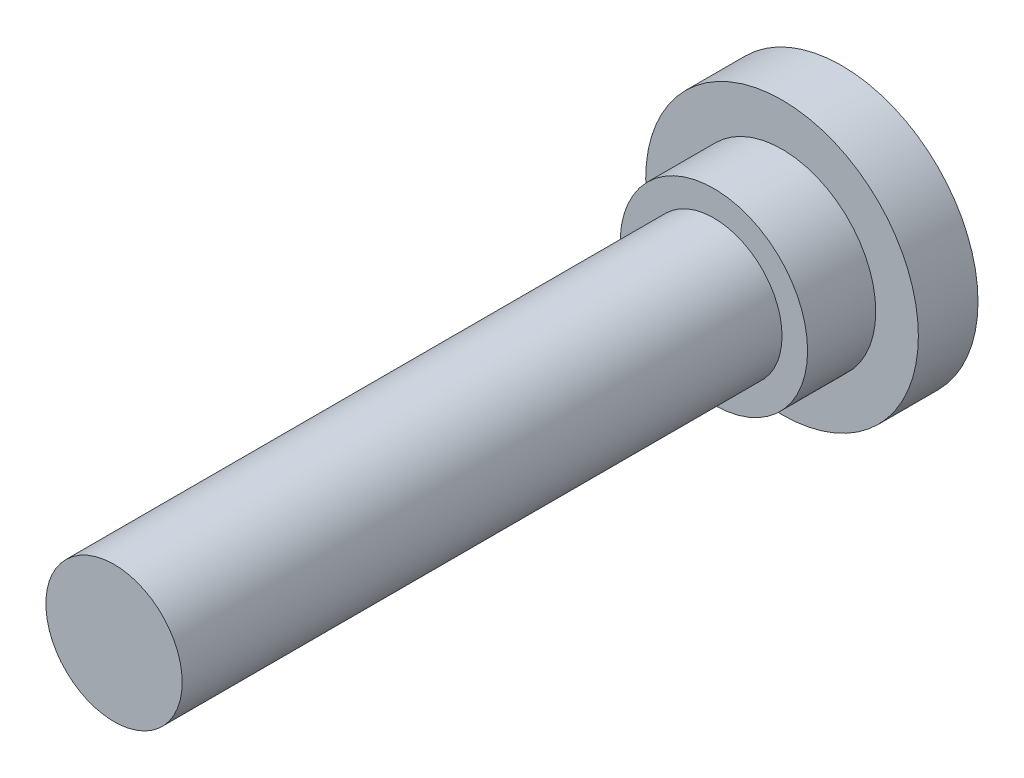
ISO-10303-21;
HEADER;
FILE_DESCRIPTION(('STEP AP214'),'2;1');
FILE_NAME('part.step','',(''),(''),'','','');
FILE_SCHEMA(('AUTOMOTIVE_DESIGN { 1 0 10303 214 1 1 1 1 }'));
ENDSEC;
DATA;
#1=APPLICATION_CONTEXT('core data for automotive mechanical design processes');
#2=APPLICATION_PROTOCOL_DEFINITION('international standard','automotive_design',2000,#1);
#3=PRODUCT_CONTEXT('',#1,'mechanical');
#4=PRODUCT('Part','Part','',(#3));
#5=PRODUCT_RELATED_PRODUCT_CATEGORY('part','',(#4));
#6=PRODUCT_DEFINITION_FORMATION('','',#4);
#7=PRODUCT_DEFINITION_CONTEXT('part definition',#1,'design');
#8=PRODUCT_DEFINITION('design','',#6,#7);
#9=PRODUCT_DEFINITION_SHAPE('','',#8);
#10=(LENGTH_UNIT() NAMED_UNIT(*) SI_UNIT(.MILLI.,.METRE.));
#11=(NAMED_UNIT(*) PLANE_ANGLE_UNIT() SI_UNIT($,.RADIAN.));
#12=(NAMED_UNIT(*) SI_UNIT($,.STERADIAN.) SOLID_ANGLE_UNIT());
#13=UNCERTAINTY_MEASURE_WITH_UNIT(LENGTH_MEASURE(1.E-05),#10,'distance_accuracy_value','');
#14=(GEOMETRIC_REPRESENTATION_CONTEXT(3) GLOBAL_UNCERTAINTY_ASSIGNED_CONTEXT((#13)) GLOBAL_UNIT_ASSIGNED_CONTEXT((#10,
#11,#12)) REPRESENTATION_CONTEXT('',''));
#15=CARTESIAN_POINT('',(0.,0.,0.));
#16=DIRECTION('',(0.,0.,1.));
#17=DIRECTION('',(1.,0.,0.));
#18=AXIS2_PLACEMENT_3D('',#15,#16,#17);
#19=CARTESIAN_POINT('',(0.,0.,85.4));
#20=DIRECTION('',(0.,0.,1.));
#21=DIRECTION('',(1.,0.,0.));
#22=AXIS2_PLACEMENT_3D('',#19,#20,#21);
#23=PLANE('',#22);
#24=CARTESIAN_POINT('',(0.,0.,85.4));
#25=DIRECTION('',(0.,0.,1.));
#26=DIRECTION('',(1.,0.,0.));
#27=AXIS2_PLACEMENT_3D('',#24,#25,#26);
#28=CIRCLE('',#27,8.);
#29=CARTESIAN_POINT('',(8.,0.,85.4));
#30=VERTEX_POINT('',#29);
#31=EDGE_CURVE('E8',#30,#30,#28,.T.);
#32=ORIENTED_EDGE('',*,*,#31,.T.);
#33=EDGE_LOOP('',(#32));
#34=FACE_BOUND('',#33,.T.);
#35=ADVANCED_FACE('F12',(#34),#23,.T.);
#36=CARTESIAN_POINT('',(0.,0.,30.));
#37=DIRECTION('',(0.,0.,1.));
#38=DIRECTION('',(1.,0.,0.));
#39=AXIS2_PLACEMENT_3D('',#36,#37,#38);
#40=CYLINDRICAL_SURFACE('',#39,8.);
#41=CARTESIAN_POINT('',(0.,0.,15.));
#42=DIRECTION('',(0.,0.,1.));
#43=DIRECTION('',(1.,0.,0.));
#44=AXIS2_PLACEMENT_3D('',#41,#42,#43);
#45=CIRCLE('',#44,8.);
#46=CARTESIAN_POINT('',(8.,0.,15.));
#47=VERTEX_POINT('',#46);
#48=EDGE_CURVE('E18',#47,#47,#45,.T.);
#49=ORIENTED_EDGE('',*,*,#48,.T.);
#50=EDGE_LOOP('',(#49));
#51=FACE_BOUND('',#50,.T.);
#52=ORIENTED_EDGE('',*,*,#31,.F.);
#53=EDGE_LOOP('',(#52));
#54=FACE_BOUND('',#53,.T.);
#55=ADVANCED_FACE('F52',(#51,#54),#40,.T.);
#56=CARTESIAN_POINT('',(-8.,0.,15.));
#57=DIRECTION('',(0.,0.,1.));
#58=DIRECTION('',(1.,0.,0.));
#59=AXIS2_PLACEMENT_3D('',#56,#57,#58);
#60=PLANE('',#59);
#61=CARTESIAN_POINT('',(0.,0.,15.));
#62=DIRECTION('',(0.,0.,1.));
#63=DIRECTION('',(1.,0.,0.));
#64=AXIS2_PLACEMENT_3D('',#61,#62,#63);
#65=CIRCLE('',#64,11.);
#66=CARTESIAN_POINT('',(11.,0.,15.));
#67=VERTEX_POINT('',#66);
#68=EDGE_CURVE('E22',#67,#67,#65,.T.);
#69=ORIENTED_EDGE('',*,*,#68,.T.);
#70=EDGE_LOOP('',(#69));
#71=FACE_BOUND('',#70,.T.);
#72=ORIENTED_EDGE('',*,*,#48,.F.);
#73=EDGE_LOOP('',(#72));
#74=FACE_BOUND('',#73,.T.);
#75=ADVANCED_FACE('F57',(#71,#74),#60,.T.);
#76=CARTESIAN_POINT('',(0.,0.,30.));
#77=DIRECTION('',(0.,0.,1.));
#78=DIRECTION('',(1.,0.,0.));
#79=AXIS2_PLACEMENT_3D('',#76,#77,#78);
#80=CYLINDRICAL_SURFACE('',#79,11.);
#81=CARTESIAN_POINT('',(0.,0.,7.));
#82=DIRECTION('',(0.,0.,1.));
#83=DIRECTION('',(1.,0.,0.));
#84=AXIS2_PLACEMENT_3D('',#81,#82,#83);
#85=CIRCLE('',#84,11.);
#86=CARTESIAN_POINT('',(11.,0.,7.));
#87=VERTEX_POINT('',#86);
#88=EDGE_CURVE('E26',#87,#87,#85,.T.);
#89=ORIENTED_EDGE('',*,*,#88,.T.);
#90=EDGE_LOOP('',(#89));
#91=FACE_BOUND('',#90,.T.);
#92=ORIENTED_EDGE('',*,*,#68,.F.);
#93=EDGE_LOOP('',(#92));
#94=FACE_BOUND('',#93,.T.);
#95=ADVANCED_FACE('F62',(#91,#94),#80,.T.);
#96=CARTESIAN_POINT('',(-11.,0.,7.));
#97=DIRECTION('',(0.,0.,1.));
#98=DIRECTION('',(1.,0.,0.));
#99=AXIS2_PLACEMENT_3D('',#96,#97,#98);
#100=PLANE('',#99);
#101=CARTESIAN_POINT('',(0.,0.,7.));
#102=DIRECTION('',(0.,0.,1.));
#103=DIRECTION('',(1.,0.,0.));
#104=AXIS2_PLACEMENT_3D('',#101,#102,#103);
#105=CIRCLE('',#104,16.);
#106=CARTESIAN_POINT('',(16.,0.,7.));
#107=VERTEX_POINT('',#106);
#108=EDGE_CURVE('E31',#107,#107,#105,.T.);
#109=ORIENTED_EDGE('',*,*,#108,.T.);
#110=EDGE_LOOP('',(#109));
#111=FACE_BOUND('',#110,.T.);
#112=ORIENTED_EDGE('',*,*,#88,.F.);
#113=EDGE_LOOP('',(#112));
#114=FACE_BOUND('',#113,.T.);
#115=ADVANCED_FACE('F49',(#111,#114),#100,.T.);
#116=CARTESIAN_POINT('',(0.,0.,30.));
#117=DIRECTION('',(0.,0.,1.));
#118=DIRECTION('',(1.,0.,0.));
#119=AXIS2_PLACEMENT_3D('',#116,#117,#118);
#120=CYLINDRICAL_SURFACE('',#119,16.);
#121=CARTESIAN_POINT('',(0.,0.,0.));
#122=DIRECTION('',(0.,0.,1.));
#123=DIRECTION('',(1.,0.,0.));
#124=AXIS2_PLACEMENT_3D('',#121,#122,#123);
#125=CIRCLE('',#124,16.);
#126=CARTESIAN_POINT('',(16.,0.,0.));
#127=VERTEX_POINT('',#126);
#128=EDGE_CURVE('E34',#127,#127,#125,.T.);
#129=ORIENTED_EDGE('',*,*,#128,.T.);
#130=EDGE_LOOP('',(#129));
#131=FACE_BOUND('',#130,.T.);
#132=ORIENTED_EDGE('',*,*,#108,.F.);
#133=EDGE_LOOP('',(#132));
#134=FACE_BOUND('',#133,.T.);
#135=ADVANCED_FACE('F38',(#131,#134),#120,.T.);
#136=CARTESIAN_POINT('',(-16.,0.,0.));
#137=DIRECTION('',(0.,0.,-1.));
#138=DIRECTION('',(-1.,0.,0.));
#139=AXIS2_PLACEMENT_3D('',#136,#137,#138);
#140=PLANE('',#139);
#141=ORIENTED_EDGE('',*,*,#128,.F.);
#142=EDGE_LOOP('',(#141));
#143=FACE_BOUND('',#142,.T.);
#144=ADVANCED_FACE('F41',(#143),#140,.T.);
#145=CLOSED_SHELL('',(#35,#55,#75,#95,#115,#135,#144));
#146=MANIFOLD_SOLID_BREP('B1',#145);
#147=ADVANCED_BREP_SHAPE_REPRESENTATION('',(#18,#146),#14);
#148=SHAPE_DEFINITION_REPRESENTATION(#9,#147);
ENDSEC;
END-ISO-10303-21;
